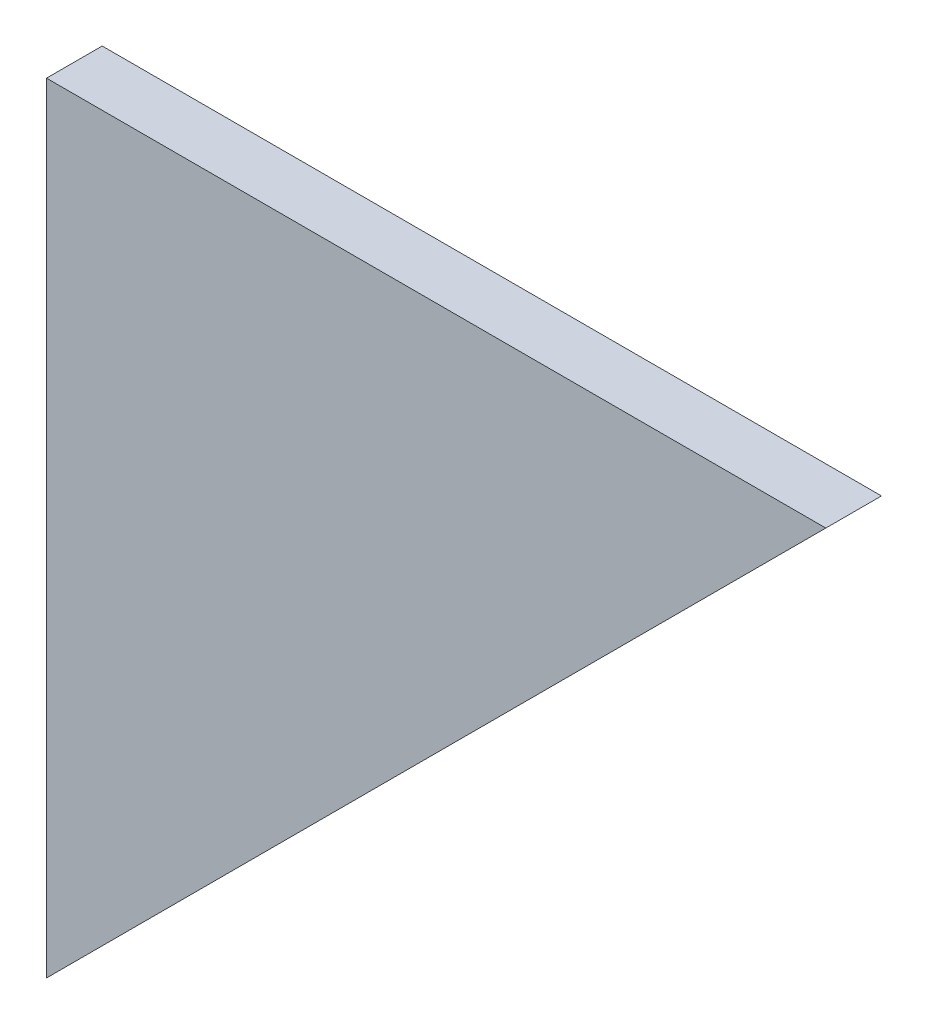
ISO-10303-21;
HEADER;
FILE_DESCRIPTION(('STEP AP214'),'2;1');
FILE_NAME('part.step','',(''),(''),'','','');
FILE_SCHEMA(('AUTOMOTIVE_DESIGN { 1 0 10303 214 1 1 1 1 }'));
ENDSEC;
DATA;
#1=APPLICATION_CONTEXT('core data for automotive mechanical design processes');
#2=APPLICATION_PROTOCOL_DEFINITION('international standard','automotive_design',2000,#1);
#3=PRODUCT_CONTEXT('',#1,'mechanical');
#4=PRODUCT('Part','Part','',(#3));
#5=PRODUCT_RELATED_PRODUCT_CATEGORY('part','',(#4));
#6=PRODUCT_DEFINITION_FORMATION('','',#4);
#7=PRODUCT_DEFINITION_CONTEXT('part definition',#1,'design');
#8=PRODUCT_DEFINITION('design','',#6,#7);
#9=PRODUCT_DEFINITION_SHAPE('','',#8);
#10=(LENGTH_UNIT() NAMED_UNIT(*) SI_UNIT(.MILLI.,.METRE.));
#11=(NAMED_UNIT(*) PLANE_ANGLE_UNIT() SI_UNIT($,.RADIAN.));
#12=(NAMED_UNIT(*) SI_UNIT($,.STERADIAN.) SOLID_ANGLE_UNIT());
#13=UNCERTAINTY_MEASURE_WITH_UNIT(LENGTH_MEASURE(1.E-05),#10,'distance_accuracy_value','');
#14=(GEOMETRIC_REPRESENTATION_CONTEXT(3) GLOBAL_UNCERTAINTY_ASSIGNED_CONTEXT((#13)) GLOBAL_UNIT_ASSIGNED_CONTEXT((#10,
#11,#12)) REPRESENTATION_CONTEXT('',''));
#15=CARTESIAN_POINT('',(0.,0.,0.));
#16=DIRECTION('',(0.,0.,1.));
#17=DIRECTION('',(1.,0.,0.));
#18=AXIS2_PLACEMENT_3D('',#15,#16,#17);
#19=CARTESIAN_POINT('',(0.,0.,5.));
#20=DIRECTION('',(1.,0.,0.));
#21=DIRECTION('',(0.,1.,0.));
#22=AXIS2_PLACEMENT_3D('',#19,#20,#21);
#23=PLANE('',#22);
#24=DIRECTION('',(0.,-1.,0.));
#25=VECTOR('',#24,1.);
#26=CARTESIAN_POINT('',(0.,0.,0.));
#27=LINE('',#26,#25);
#28=CARTESIAN_POINT('',(0.,0.,0.));
#29=VERTEX_POINT('',#28);
#30=CARTESIAN_POINT('',(0.,-70.,0.));
#31=VERTEX_POINT('',#30);
#32=EDGE_CURVE('E67',#29,#31,#27,.T.);
#33=ORIENTED_EDGE('',*,*,#32,.T.);
#34=DIRECTION('',(0.,0.,-1.));
#35=VECTOR('',#34,1.);
#36=CARTESIAN_POINT('',(0.,-70.,5.));
#37=LINE('',#36,#35);
#38=CARTESIAN_POINT('',(0.,-70.,5.));
#39=VERTEX_POINT('',#38);
#40=EDGE_CURVE('E11',#39,#31,#37,.T.);
#41=ORIENTED_EDGE('',*,*,#40,.F.);
#42=DIRECTION('',(0.,-1.,0.));
#43=VECTOR('',#42,1.);
#44=CARTESIAN_POINT('',(0.,0.,5.));
#45=LINE('',#44,#43);
#46=CARTESIAN_POINT('',(0.,0.,5.));
#47=VERTEX_POINT('',#46);
#48=EDGE_CURVE('E81',#47,#39,#45,.T.);
#49=ORIENTED_EDGE('',*,*,#48,.F.);
#50=DIRECTION('',(0.,0.,-1.));
#51=VECTOR('',#50,1.);
#52=CARTESIAN_POINT('',(0.,0.,5.));
#53=LINE('',#52,#51);
#54=EDGE_CURVE('E77',#47,#29,#53,.T.);
#55=ORIENTED_EDGE('',*,*,#54,.T.);
#56=EDGE_LOOP('',(#33,#41,#49,#55));
#57=FACE_BOUND('',#56,.T.);
#58=ADVANCED_FACE('F31',(#57),#23,.F.);
#59=CARTESIAN_POINT('',(70.,0.,5.));
#60=DIRECTION('',(-0.707106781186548,0.707106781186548,0.));
#61=DIRECTION('',(-0.707106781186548,-0.707106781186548,0.));
#62=AXIS2_PLACEMENT_3D('',#59,#60,#61);
#63=PLANE('',#62);
#64=DIRECTION('',(0.707106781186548,0.707106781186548,0.));
#65=VECTOR('',#64,1.);
#66=CARTESIAN_POINT('',(70.,0.,0.));
#67=LINE('',#66,#65);
#68=CARTESIAN_POINT('',(70.,0.,0.));
#69=VERTEX_POINT('',#68);
#70=EDGE_CURVE('E64',#31,#69,#67,.T.);
#71=ORIENTED_EDGE('',*,*,#70,.T.);
#72=DIRECTION('',(0.,0.,-1.));
#73=VECTOR('',#72,1.);
#74=CARTESIAN_POINT('',(70.,0.,5.));
#75=LINE('',#74,#73);
#76=CARTESIAN_POINT('',(70.,0.,5.));
#77=VERTEX_POINT('',#76);
#78=EDGE_CURVE('E38',#77,#69,#75,.T.);
#79=ORIENTED_EDGE('',*,*,#78,.F.);
#80=DIRECTION('',(0.707106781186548,0.707106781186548,0.));
#81=VECTOR('',#80,1.);
#82=CARTESIAN_POINT('',(70.,0.,5.));
#83=LINE('',#82,#81);
#84=EDGE_CURVE('E49',#39,#77,#83,.T.);
#85=ORIENTED_EDGE('',*,*,#84,.F.);
#86=ORIENTED_EDGE('',*,*,#40,.T.);
#87=EDGE_LOOP('',(#71,#79,#85,#86));
#88=FACE_BOUND('',#87,.T.);
#89=ADVANCED_FACE('F73',(#88),#63,.F.);
#90=CARTESIAN_POINT('',(0.,0.,5.));
#91=DIRECTION('',(0.,-1.,0.));
#92=DIRECTION('',(0.,0.,-1.));
#93=AXIS2_PLACEMENT_3D('',#90,#91,#92);
#94=PLANE('',#93);
#95=DIRECTION('',(-1.,0.,0.));
#96=VECTOR('',#95,1.);
#97=CARTESIAN_POINT('',(0.,0.,0.));
#98=LINE('',#97,#96);
#99=EDGE_CURVE('E68',#69,#29,#98,.T.);
#100=ORIENTED_EDGE('',*,*,#99,.T.);
#101=ORIENTED_EDGE('',*,*,#54,.F.);
#102=DIRECTION('',(-1.,0.,0.));
#103=VECTOR('',#102,1.);
#104=CARTESIAN_POINT('',(0.,0.,5.));
#105=LINE('',#104,#103);
#106=EDGE_CURVE('E45',#77,#47,#105,.T.);
#107=ORIENTED_EDGE('',*,*,#106,.F.);
#108=ORIENTED_EDGE('',*,*,#78,.T.);
#109=EDGE_LOOP('',(#100,#101,#107,#108));
#110=FACE_BOUND('',#109,.T.);
#111=ADVANCED_FACE('F86',(#110),#94,.F.);
#112=CARTESIAN_POINT('',(0.,0.,5.));
#113=DIRECTION('',(0.,0.,1.));
#114=DIRECTION('',(1.,0.,0.));
#115=AXIS2_PLACEMENT_3D('',#112,#113,#114);
#116=PLANE('',#115);
#117=ORIENTED_EDGE('',*,*,#48,.T.);
#118=ORIENTED_EDGE('',*,*,#84,.T.);
#119=ORIENTED_EDGE('',*,*,#106,.T.);
#120=EDGE_LOOP('',(#117,#118,#119));
#121=FACE_BOUND('',#120,.T.);
#122=ADVANCED_FACE('F87',(#121),#116,.T.);
#123=CARTESIAN_POINT('',(0.,0.,0.));
#124=DIRECTION('',(0.,0.,1.));
#125=DIRECTION('',(1.,0.,0.));
#126=AXIS2_PLACEMENT_3D('',#123,#124,#125);
#127=PLANE('',#126);
#128=ORIENTED_EDGE('',*,*,#32,.F.);
#129=ORIENTED_EDGE('',*,*,#99,.F.);
#130=ORIENTED_EDGE('',*,*,#70,.F.);
#131=EDGE_LOOP('',(#128,#129,#130));
#132=FACE_BOUND('',#131,.T.);
#133=ADVANCED_FACE('F65',(#132),#127,.F.);
#134=CLOSED_SHELL('',(#58,#89,#111,#122,#133));
#135=MANIFOLD_SOLID_BREP('B2',#134);
#136=ADVANCED_BREP_SHAPE_REPRESENTATION('',(#18,#135),#14);
#137=SHAPE_DEFINITION_REPRESENTATION(#9,#136);
ENDSEC;
END-ISO-10303-21;
